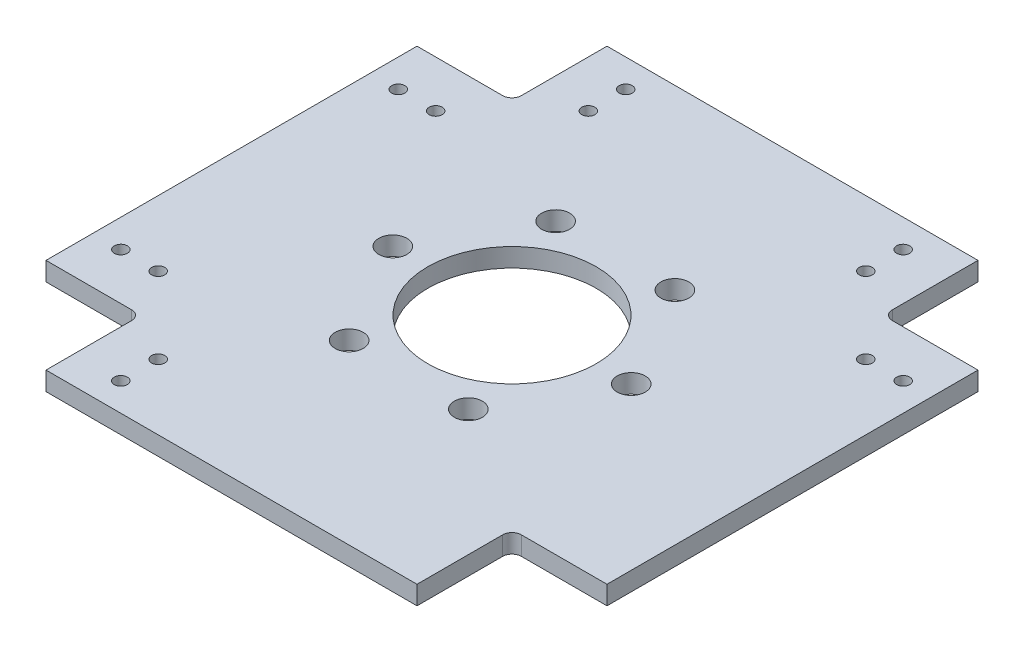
from build123d import *

# Parameters (mm, degrees)
SKETCH1_R           = 45
BOSS_EXTRUDE1_DEPTH = 10
FILLET1_R           = 5
SKETCH2_R           = 6.35
CUT_EXTRUDE1_DEPTH  = 5
CHAMFER1_SIZE       = 1
SKETCH3_R           = 3.5
CUT_EXTRUDE2_DEPTH  = 213.367605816
SKETCH4_R           = 7.5
CUT_EXTRUDE3_DEPTH  = 213.367605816


with BuildPart() as part:
    # Sketch1 → Boss-Extrude1 (new body)
    with BuildSketch(Plane(origin=(0, 0, 0), x_dir=(1, 0, 0), z_dir=(0, 1, 0))):
        Polygon((-99.2, 150), (-99.2, 99.2), (-150, 99.2), (-150, -99.2), (-99.2, -99.2), (-99.2, -150), (99.2, -150), (99.2, -99.2), (150, -99.2), (150, 99.2), (99.2, 99.2), (99.2, 150), align=None)
        with Locations(Location((0, 0, 0), (0, 0, 270))):
            Circle(SKETCH1_R, mode=Mode.SUBTRACT)
    extrude(amount=BOSS_EXTRUDE1_DEPTH)

    # Fillet1
    fillet1_edges = [part.edges().sort_by_distance(p)[0] for p in [
        (-99.2, 5, 99.2),
        (-99.2, 5, -99.2),
        (99.2, 5, -99.2),
        (99.2, 5, 99.2),
    ]]
    fillet(fillet1_edges, radius=FILLET1_R)

    # Sketch2 → Cut-Extrude1 (cut)
    with BuildSketch(Plane.XZ):
        with Locations(Location((40.127920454, -80, 0), (0, 0, 270))):
            Circle(SKETCH2_R)
        with Locations(Location((-40.127920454, -80, 0), (0, 0, 270))):
            Circle(SKETCH2_R)
        with Locations(Location((40.127920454, 80, 0), (0, 0, 270))):
            Circle(SKETCH2_R)
        with Locations(Location((-40.127920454, 80, 0), (0, 0, 270))):
            Circle(SKETCH2_R)
    extrude(amount=-CUT_EXTRUDE1_DEPTH, mode=Mode.SUBTRACT)

    # Chamfer1
    chamfer1_edges = [part.edges().sort_by_distance(p)[0] for p in [
        (-40.127920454, 0, -73.65),
        (40.127920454, 0, 86.35),
        (-40.127920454, 0, 86.35),
        (40.127920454, 0, -73.65),
    ]]
    chamfer(chamfer1_edges, length=CHAMFER1_SIZE)

    # Sketch3 → Cut-Extrude2 (cut, through all)
    with BuildSketch(Plane(origin=(0, 10, 0), x_dir=(1, 0, 0), z_dir=(0, 1, 0))):
        with Locations(Location((-135, 74.19999999, 0), (0, 0, 270))):
            Circle(SKETCH3_R)
        with Locations(Location((-115, 74.19999999, 0), (0, 0, 270))):
            Circle(SKETCH3_R)
        with Locations(Location((-74.19999999, 135, 0), (0, 0, 270))):
            Circle(SKETCH3_R)
        with Locations(Location((-74.19999999, 115, 0), (0, 0, 270))):
            Circle(SKETCH3_R)
        with Locations(Location((74.19999999, 115, 0), (0, 0, 270))):
            Circle(SKETCH3_R)
        with Locations(Location((74.19999999, 135, 0), (0, 0, 270))):
            Circle(SKETCH3_R)
        with Locations(Location((115, 74.19999999, 0), (0, 0, 270))):
            Circle(SKETCH3_R)
        with Locations(Location((135, 74.19999999, 0), (0, 0, 270))):
            Circle(SKETCH3_R)
        with Locations(Location((-74.19999999, -135, 0), (0, 0, 270))):
            Circle(SKETCH3_R)
        with Locations(Location((-74.19999999, -115, 0), (0, 0, 270))):
            Circle(SKETCH3_R)
        with Locations(Location((-135, -74.19999999, 0), (0, 0, 270))):
            Circle(SKETCH3_R)
        with Locations(Location((-115, -74.19999999, 0), (0, 0, 270))):
            Circle(SKETCH3_R)
    extrude(amount=-CUT_EXTRUDE2_DEPTH, mode=Mode.SUBTRACT)

    # Sketch4 → Cut-Extrude3 (cut, through all)
    with BuildSketch(Plane.XZ):
        with Locations(Location((-31.875, -55.209119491, 0), (0, 0, 270))):
            Circle(SKETCH4_R)
        with Locations(Location((31.875, -55.209119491, 0), (0, 0, 270))):
            Circle(SKETCH4_R)
        with Locations(Location((63.75, 0, 0), (0, 0, 270))):
            Circle(SKETCH4_R)
        with Locations(Location((31.875, 55.209119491, 0), (0, 0, 270))):
            Circle(SKETCH4_R)
        with Locations(Location((-31.875, 55.209119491, 0), (0, 0, 270))):
            Circle(SKETCH4_R)
        with Locations(Location((-63.75, 0, 0), (0, 0, 270))):
            Circle(SKETCH4_R)
    extrude(amount=-CUT_EXTRUDE3_DEPTH, mode=Mode.SUBTRACT)


solid = part.part
